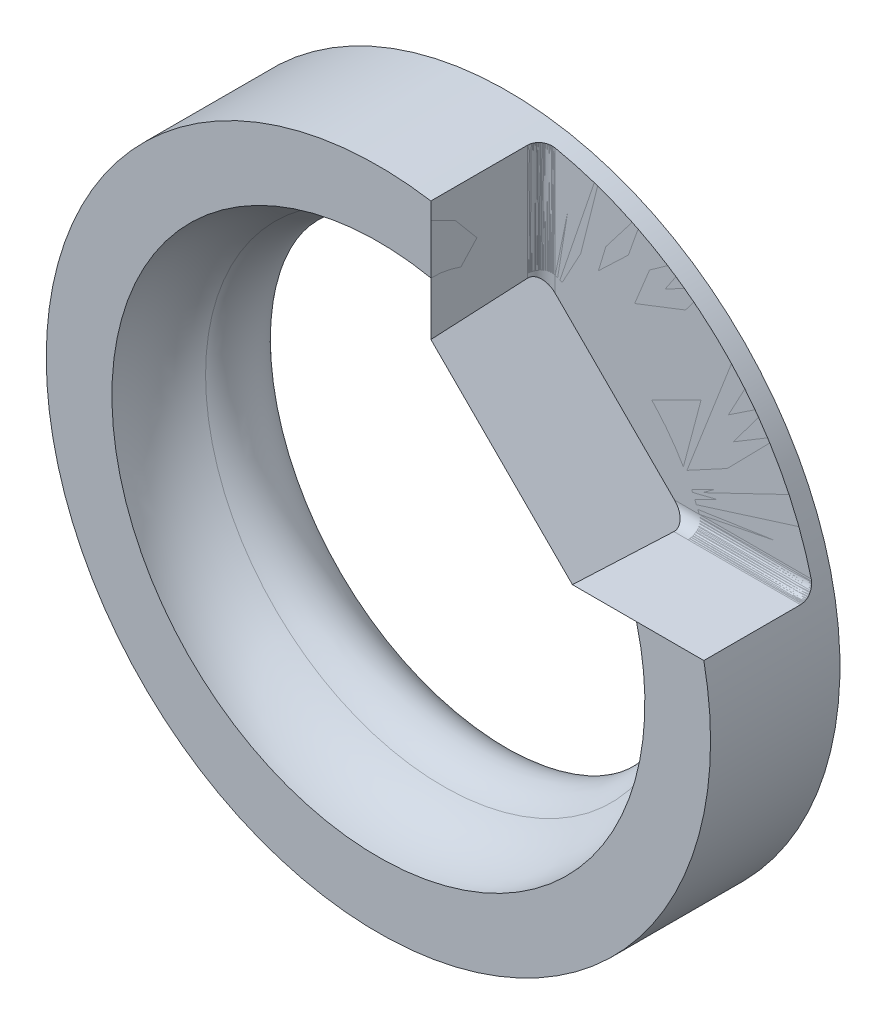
from build123d import *

# Parameters (mm, degrees)
SKIZZE3_W                       = 65.048223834
SKIZZE3_H                       = 62.552040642
SCHNITT_LINEAR_AUSTRAGEN1_DEPTH = 24
VERRUNDUNG1_R                   = 3


with BuildPart() as part:
    # Skizze2 → Rotation1 (revolve)
    with BuildSketch(Plane(origin=(0, 0, 0), x_dir=(0, 0, -1), z_dir=(1, 0, 0)), mode=Mode.PRIVATE) as rotation1_sk:
        with BuildLine():
            Line((0, 72.135077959), (-28.099129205, 72.135077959))
            Line((-28.099129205, 72.135077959), (-28.099129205, 57.875818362))
            ThreePointArc((-28.099129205, 57.875818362), (-20.402294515, 56.231310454), (-14.049564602, 51.58496854))
            ThreePointArc((-14.049564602, 51.58496854), (-7.024782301, 48.439543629), (0, 51.58496854))
            Line((0, 51.58496854), (0, 72.135077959))
        make_face()
    revolve(rotation1_sk.sketch.rotate(Axis((0, 0, 0), (0, 0, 1)), 90), axis=Axis((0, 0, 0), (0, 0, 1)))

    # Skizze3 → Schnitt-Linear austragen1 (cut)
    with BuildSketch(Plane.XY.offset(28.099129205)):
        with Locations((43.924705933, 45.706682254)):
            Rectangle(SKIZZE3_W, SKIZZE3_H)
    extrude(amount=-SCHNITT_LINEAR_AUSTRAGEN1_DEPTH, mode=Mode.SUBTRACT)

    # Verrundung1
    verrundung1_edges = [part.edges().sort_by_distance(p)[0] for p in [
        (58.70246367, 14.430661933, 4.099129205),
        (11.400594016, 59.393316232, 4.099129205),
    ]]
    fillet(verrundung1_edges, radius=VERRUNDUNG1_R)


solid = part.part
